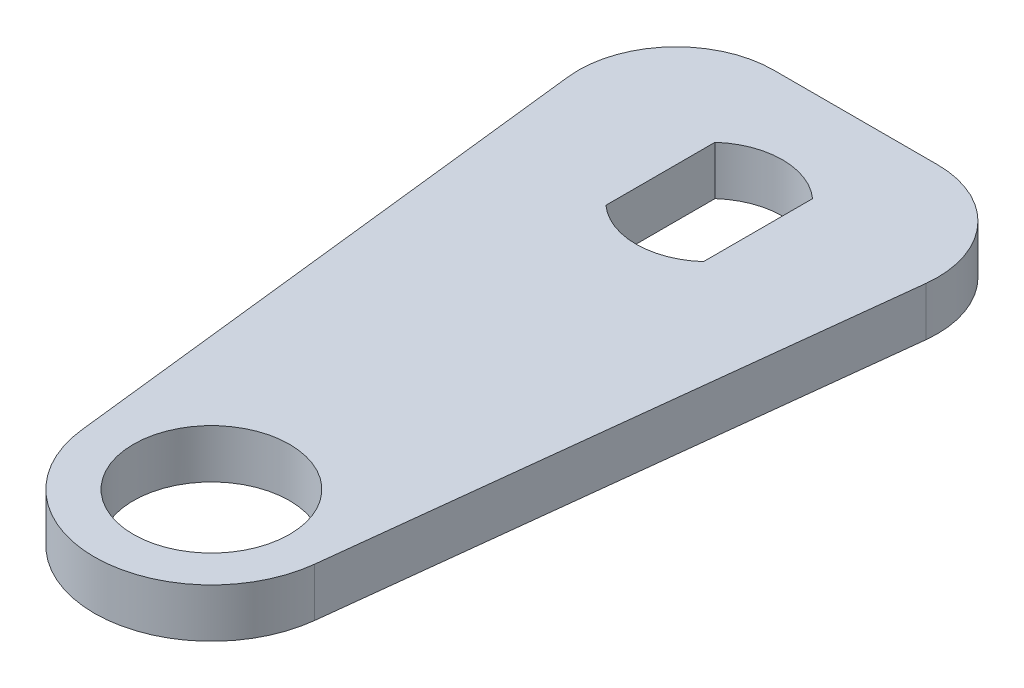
ISO-10303-21;
HEADER;
FILE_DESCRIPTION(('STEP AP214'),'2;1');
FILE_NAME('part.step','',(''),(''),'','','');
FILE_SCHEMA(('AUTOMOTIVE_DESIGN { 1 0 10303 214 1 1 1 1 }'));
ENDSEC;
DATA;
#1=APPLICATION_CONTEXT('core data for automotive mechanical design processes');
#2=APPLICATION_PROTOCOL_DEFINITION('international standard','automotive_design',2000,#1);
#3=PRODUCT_CONTEXT('',#1,'mechanical');
#4=PRODUCT('Part','Part','',(#3));
#5=PRODUCT_RELATED_PRODUCT_CATEGORY('part','',(#4));
#6=PRODUCT_DEFINITION_FORMATION('','',#4);
#7=PRODUCT_DEFINITION_CONTEXT('part definition',#1,'design');
#8=PRODUCT_DEFINITION('design','',#6,#7);
#9=PRODUCT_DEFINITION_SHAPE('','',#8);
#10=(LENGTH_UNIT() NAMED_UNIT(*) SI_UNIT(.MILLI.,.METRE.));
#11=(NAMED_UNIT(*) PLANE_ANGLE_UNIT() SI_UNIT($,.RADIAN.));
#12=(NAMED_UNIT(*) SI_UNIT($,.STERADIAN.) SOLID_ANGLE_UNIT());
#13=UNCERTAINTY_MEASURE_WITH_UNIT(LENGTH_MEASURE(1.E-05),#10,'distance_accuracy_value','');
#14=(GEOMETRIC_REPRESENTATION_CONTEXT(3) GLOBAL_UNCERTAINTY_ASSIGNED_CONTEXT((#13)) GLOBAL_UNIT_ASSIGNED_CONTEXT((#10,
#11,#12)) REPRESENTATION_CONTEXT('',''));
#15=CARTESIAN_POINT('',(0.,0.,0.));
#16=DIRECTION('',(0.,0.,1.));
#17=DIRECTION('',(1.,0.,0.));
#18=AXIS2_PLACEMENT_3D('',#15,#16,#17);
#19=CARTESIAN_POINT('',(-15.8316340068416,5.,18.0515893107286));
#20=DIRECTION('',(-0.993571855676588,0.,0.1132032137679));
#21=DIRECTION('',(0.1132032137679,0.,0.993571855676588));
#22=AXIS2_PLACEMENT_3D('',#19,#20,#21);
#23=PLANE('',#22);
#24=DIRECTION('',(-0.1132032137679,0.,-0.993571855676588));
#25=VECTOR('',#24,1.);
#26=CARTESIAN_POINT('',(-15.8316340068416,5.,18.0515893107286));
#27=LINE('',#26,#25);
#28=CARTESIAN_POINT('',(-11.9228622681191,5.,52.3584385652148));
#29=VERTEX_POINT('',#28);
#30=CARTESIAN_POINT('',(-18.3290520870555,5.,-3.867967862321));
#31=VERTEX_POINT('',#30);
#32=EDGE_CURVE('E150',#29,#31,#27,.T.);
#33=ORIENTED_EDGE('',*,*,#32,.T.);
#34=DIRECTION('',(0.,-1.,0.));
#35=VECTOR('',#34,1.);
#36=CARTESIAN_POINT('',(-18.3290520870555,0.,-3.867967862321));
#37=LINE('',#36,#35);
#38=CARTESIAN_POINT('',(-18.3290520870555,0.,-3.867967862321));
#39=VERTEX_POINT('',#38);
#40=EDGE_CURVE('E11',#31,#39,#37,.T.);
#41=ORIENTED_EDGE('',*,*,#40,.T.);
#42=DIRECTION('',(-0.1132032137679,0.,-0.993571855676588));
#43=VECTOR('',#42,1.);
#44=CARTESIAN_POINT('',(-15.8316340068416,0.,18.0515893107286));
#45=LINE('',#44,#43);
#46=CARTESIAN_POINT('',(-11.9228622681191,0.,52.3584385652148));
#47=VERTEX_POINT('',#46);
#48=EDGE_CURVE('E169',#47,#39,#45,.T.);
#49=ORIENTED_EDGE('',*,*,#48,.F.);
#50=DIRECTION('',(0.,-1.,0.));
#51=VECTOR('',#50,1.);
#52=CARTESIAN_POINT('',(-11.9228622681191,5.,52.3584385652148));
#53=LINE('',#52,#51);
#54=EDGE_CURVE('E178',#29,#47,#53,.T.);
#55=ORIENTED_EDGE('',*,*,#54,.F.);
#56=EDGE_LOOP('',(#33,#41,#49,#55));
#57=FACE_BOUND('',#56,.T.);
#58=ADVANCED_FACE('F34',(#57),#23,.T.);
#59=CARTESIAN_POINT('',(0.,5.,51.));
#60=DIRECTION('',(0.,-1.,0.));
#61=DIRECTION('',(0.,0.,-1.));
#62=AXIS2_PLACEMENT_3D('',#59,#60,#61);
#63=CYLINDRICAL_SURFACE('',#62,12.);
#64=CARTESIAN_POINT('',(0.,0.,51.));
#65=DIRECTION('',(0.,1.,0.));
#66=DIRECTION('',(0.,0.,1.));
#67=AXIS2_PLACEMENT_3D('',#64,#65,#66);
#68=CIRCLE('',#67,12.);
#69=CARTESIAN_POINT('',(11.922862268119,0.,52.3584385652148));
#70=VERTEX_POINT('',#69);
#71=EDGE_CURVE('E172',#47,#70,#68,.T.);
#72=ORIENTED_EDGE('',*,*,#71,.T.);
#73=DIRECTION('',(0.,-1.,0.));
#74=VECTOR('',#73,1.);
#75=CARTESIAN_POINT('',(11.922862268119,5.,52.3584385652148));
#76=LINE('',#75,#74);
#77=CARTESIAN_POINT('',(11.922862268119,5.,52.3584385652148));
#78=VERTEX_POINT('',#77);
#79=EDGE_CURVE('E125',#78,#70,#76,.T.);
#80=ORIENTED_EDGE('',*,*,#79,.F.);
#81=CARTESIAN_POINT('',(0.,5.,51.));
#82=DIRECTION('',(0.,1.,0.));
#83=DIRECTION('',(0.,0.,1.));
#84=AXIS2_PLACEMENT_3D('',#81,#82,#83);
#85=CIRCLE('',#84,12.);
#86=EDGE_CURVE('E152',#29,#78,#85,.T.);
#87=ORIENTED_EDGE('',*,*,#86,.F.);
#88=ORIENTED_EDGE('',*,*,#54,.T.);
#89=EDGE_LOOP('',(#72,#80,#87,#88));
#90=FACE_BOUND('',#89,.T.);
#91=ADVANCED_FACE('F210',(#90),#63,.T.);
#92=CARTESIAN_POINT('',(14.0877689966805,5.,33.3572960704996));
#93=DIRECTION('',(-0.993571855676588,0.,-0.1132032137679));
#94=DIRECTION('',(-0.1132032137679,0.,0.993571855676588));
#95=AXIS2_PLACEMENT_3D('',#92,#93,#94);
#96=PLANE('',#95);
#97=DIRECTION('',(0.1132032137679,0.,-0.993571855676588));
#98=VECTOR('',#97,1.);
#99=CARTESIAN_POINT('',(14.0877689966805,0.,33.3572960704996));
#100=LINE('',#99,#98);
#101=CARTESIAN_POINT('',(18.3290520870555,0.,-3.86796786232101));
#102=VERTEX_POINT('',#101);
#103=EDGE_CURVE('E142',#70,#102,#100,.T.);
#104=ORIENTED_EDGE('',*,*,#103,.T.);
#105=DIRECTION('',(0.,-1.,0.));
#106=VECTOR('',#105,1.);
#107=CARTESIAN_POINT('',(18.3290520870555,5.,-3.867967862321));
#108=LINE('',#107,#106);
#109=CARTESIAN_POINT('',(18.3290520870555,5.,-3.86796786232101));
#110=VERTEX_POINT('',#109);
#111=EDGE_CURVE('E57',#102,#110,#108,.F.);
#112=ORIENTED_EDGE('',*,*,#111,.T.);
#113=DIRECTION('',(0.1132032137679,0.,-0.993571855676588));
#114=VECTOR('',#113,1.);
#115=CARTESIAN_POINT('',(14.0877689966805,5.,33.3572960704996));
#116=LINE('',#115,#114);
#117=EDGE_CURVE('E155',#78,#110,#116,.T.);
#118=ORIENTED_EDGE('',*,*,#117,.F.);
#119=ORIENTED_EDGE('',*,*,#79,.T.);
#120=EDGE_LOOP('',(#104,#112,#118,#119));
#121=FACE_BOUND('',#120,.T.);
#122=ADVANCED_FACE('F206',(#121),#96,.F.);
#123=CARTESIAN_POINT('',(0.,5.,0.));
#124=DIRECTION('',(0.,-1.,0.));
#125=DIRECTION('',(0.,0.,-1.));
#126=AXIS2_PLACEMENT_3D('',#123,#124,#125);
#127=CYLINDRICAL_SURFACE('',#126,7.5);
#128=CARTESIAN_POINT('',(0.,0.,0.));
#129=DIRECTION('',(0.,1.,0.));
#130=DIRECTION('',(0.,0.,1.));
#131=AXIS2_PLACEMENT_3D('',#128,#129,#130);
#132=CIRCLE('',#131,7.5);
#133=CARTESIAN_POINT('',(5.00000000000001,0.,-5.59016994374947));
#134=VERTEX_POINT('',#133);
#135=CARTESIAN_POINT('',(-5.,0.,-5.59016994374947));
#136=VERTEX_POINT('',#135);
#137=EDGE_CURVE('E121',#134,#136,#132,.T.);
#138=ORIENTED_EDGE('',*,*,#137,.F.);
#139=DIRECTION('',(0.,-1.,0.));
#140=VECTOR('',#139,1.);
#141=CARTESIAN_POINT('',(5.00000000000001,5.,-5.59016994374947));
#142=LINE('',#141,#140);
#143=CARTESIAN_POINT('',(5.00000000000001,5.,-5.59016994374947));
#144=VERTEX_POINT('',#143);
#145=EDGE_CURVE('E114',#144,#134,#142,.T.);
#146=ORIENTED_EDGE('',*,*,#145,.F.);
#147=CARTESIAN_POINT('',(0.,5.,0.));
#148=DIRECTION('',(0.,1.,0.));
#149=DIRECTION('',(0.,0.,1.));
#150=AXIS2_PLACEMENT_3D('',#147,#148,#149);
#151=CIRCLE('',#150,7.5);
#152=CARTESIAN_POINT('',(-5.,5.,-5.59016994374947));
#153=VERTEX_POINT('',#152);
#154=EDGE_CURVE('E118',#144,#153,#151,.T.);
#155=ORIENTED_EDGE('',*,*,#154,.T.);
#156=DIRECTION('',(0.,-1.,0.));
#157=VECTOR('',#156,1.);
#158=CARTESIAN_POINT('',(-5.,5.,-5.59016994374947));
#159=LINE('',#158,#157);
#160=EDGE_CURVE('E159',#153,#136,#159,.T.);
#161=ORIENTED_EDGE('',*,*,#160,.T.);
#162=EDGE_LOOP('',(#138,#146,#155,#161));
#163=FACE_BOUND('',#162,.T.);
#164=ADVANCED_FACE('F116',(#163),#127,.F.);
#165=CARTESIAN_POINT('',(5.00000000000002,5.,24.));
#166=DIRECTION('',(1.,0.,0.));
#167=DIRECTION('',(0.,0.,-1.));
#168=AXIS2_PLACEMENT_3D('',#165,#166,#167);
#169=PLANE('',#168);
#170=DIRECTION('',(0.,0.,1.));
#171=VECTOR('',#170,1.);
#172=CARTESIAN_POINT('',(5.00000000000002,0.,24.));
#173=LINE('',#172,#171);
#174=CARTESIAN_POINT('',(5.00000000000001,0.,5.59016994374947));
#175=VERTEX_POINT('',#174);
#176=EDGE_CURVE('E161',#134,#175,#173,.T.);
#177=ORIENTED_EDGE('',*,*,#176,.T.);
#178=DIRECTION('',(0.,-1.,0.));
#179=VECTOR('',#178,1.);
#180=CARTESIAN_POINT('',(5.00000000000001,5.,5.59016994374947));
#181=LINE('',#180,#179);
#182=CARTESIAN_POINT('',(5.00000000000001,5.,5.59016994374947));
#183=VERTEX_POINT('',#182);
#184=EDGE_CURVE('E126',#183,#175,#181,.T.);
#185=ORIENTED_EDGE('',*,*,#184,.F.);
#186=DIRECTION('',(0.,0.,1.));
#187=VECTOR('',#186,1.);
#188=CARTESIAN_POINT('',(5.00000000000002,5.,24.));
#189=LINE('',#188,#187);
#190=EDGE_CURVE('E129',#144,#183,#189,.T.);
#191=ORIENTED_EDGE('',*,*,#190,.F.);
#192=ORIENTED_EDGE('',*,*,#145,.T.);
#193=EDGE_LOOP('',(#177,#185,#191,#192));
#194=FACE_BOUND('',#193,.T.);
#195=ADVANCED_FACE('F130',(#194),#169,.F.);
#196=CARTESIAN_POINT('',(0.,5.,0.));
#197=DIRECTION('',(0.,-1.,0.));
#198=DIRECTION('',(0.,0.,-1.));
#199=AXIS2_PLACEMENT_3D('',#196,#197,#198);
#200=CYLINDRICAL_SURFACE('',#199,7.5);
#201=CARTESIAN_POINT('',(0.,0.,0.));
#202=DIRECTION('',(0.,1.,0.));
#203=DIRECTION('',(0.,0.,1.));
#204=AXIS2_PLACEMENT_3D('',#201,#202,#203);
#205=CIRCLE('',#204,7.5);
#206=CARTESIAN_POINT('',(-5.,0.,5.59016994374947));
#207=VERTEX_POINT('',#206);
#208=EDGE_CURVE('E163',#207,#175,#205,.T.);
#209=ORIENTED_EDGE('',*,*,#208,.F.);
#210=DIRECTION('',(0.,-1.,0.));
#211=VECTOR('',#210,1.);
#212=CARTESIAN_POINT('',(-5.,5.,5.59016994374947));
#213=LINE('',#212,#211);
#214=CARTESIAN_POINT('',(-5.,5.,5.59016994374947));
#215=VERTEX_POINT('',#214);
#216=EDGE_CURVE('E182',#215,#207,#213,.T.);
#217=ORIENTED_EDGE('',*,*,#216,.F.);
#218=CARTESIAN_POINT('',(0.,5.,0.));
#219=DIRECTION('',(0.,1.,0.));
#220=DIRECTION('',(0.,0.,1.));
#221=AXIS2_PLACEMENT_3D('',#218,#219,#220);
#222=CIRCLE('',#221,7.5);
#223=EDGE_CURVE('E134',#215,#183,#222,.T.);
#224=ORIENTED_EDGE('',*,*,#223,.T.);
#225=ORIENTED_EDGE('',*,*,#184,.T.);
#226=EDGE_LOOP('',(#209,#217,#224,#225));
#227=FACE_BOUND('',#226,.T.);
#228=ADVANCED_FACE('F234',(#227),#200,.F.);
#229=CARTESIAN_POINT('',(-5.,5.,24.));
#230=DIRECTION('',(1.,0.,0.));
#231=DIRECTION('',(0.,0.,-1.));
#232=AXIS2_PLACEMENT_3D('',#229,#230,#231);
#233=PLANE('',#232);
#234=DIRECTION('',(0.,0.,1.));
#235=VECTOR('',#234,1.);
#236=CARTESIAN_POINT('',(-5.,0.,24.));
#237=LINE('',#236,#235);
#238=EDGE_CURVE('E166',#136,#207,#237,.T.);
#239=ORIENTED_EDGE('',*,*,#238,.F.);
#240=ORIENTED_EDGE('',*,*,#160,.F.);
#241=DIRECTION('',(0.,0.,1.));
#242=VECTOR('',#241,1.);
#243=CARTESIAN_POINT('',(-5.,5.,24.));
#244=LINE('',#243,#242);
#245=EDGE_CURVE('E138',#153,#215,#244,.T.);
#246=ORIENTED_EDGE('',*,*,#245,.T.);
#247=ORIENTED_EDGE('',*,*,#216,.T.);
#248=EDGE_LOOP('',(#239,#240,#246,#247));
#249=FACE_BOUND('',#248,.T.);
#250=ADVANCED_FACE('F231',(#249),#233,.T.);
#251=CARTESIAN_POINT('',(-68.0401645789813,5.,-15.));
#252=DIRECTION('',(0.,0.,1.));
#253=DIRECTION('',(1.,0.,0.));
#254=AXIS2_PLACEMENT_3D('',#251,#252,#253);
#255=PLANE('',#254);
#256=DIRECTION('',(-1.,0.,0.));
#257=VECTOR('',#256,1.);
#258=CARTESIAN_POINT('',(-68.0401645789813,5.,-15.));
#259=LINE('',#258,#257);
#260=CARTESIAN_POINT('',(8.39333353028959,5.,-15.));
#261=VERTEX_POINT('',#260);
#262=CARTESIAN_POINT('',(-8.39333353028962,5.,-15.));
#263=VERTEX_POINT('',#262);
#264=EDGE_CURVE('E157',#261,#263,#259,.T.);
#265=ORIENTED_EDGE('',*,*,#264,.F.);
#266=DIRECTION('',(0.,-1.,0.));
#267=VECTOR('',#266,1.);
#268=CARTESIAN_POINT('',(8.39333353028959,5.,-15.));
#269=LINE('',#268,#267);
#270=CARTESIAN_POINT('',(8.39333353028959,0.,-15.));
#271=VERTEX_POINT('',#270);
#272=EDGE_CURVE('E186',#261,#271,#269,.T.);
#273=ORIENTED_EDGE('',*,*,#272,.T.);
#274=DIRECTION('',(-1.,0.,0.));
#275=VECTOR('',#274,1.);
#276=CARTESIAN_POINT('',(-68.0401645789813,0.,-15.));
#277=LINE('',#276,#275);
#278=CARTESIAN_POINT('',(-8.39333353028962,0.,-15.));
#279=VERTEX_POINT('',#278);
#280=EDGE_CURVE('E139',#271,#279,#277,.T.);
#281=ORIENTED_EDGE('',*,*,#280,.T.);
#282=DIRECTION('',(0.,-1.,0.));
#283=VECTOR('',#282,1.);
#284=CARTESIAN_POINT('',(-8.39333353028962,5.,-15.));
#285=LINE('',#284,#283);
#286=EDGE_CURVE('E180',#279,#263,#285,.F.);
#287=ORIENTED_EDGE('',*,*,#286,.T.);
#288=EDGE_LOOP('',(#265,#273,#281,#287));
#289=FACE_BOUND('',#288,.T.);
#290=ADVANCED_FACE('F199',(#289),#255,.F.);
#291=CARTESIAN_POINT('',(-68.0401645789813,5.,24.));
#292=DIRECTION('',(0.,1.,0.));
#293=DIRECTION('',(0.,0.,1.));
#294=AXIS2_PLACEMENT_3D('',#291,#292,#293);
#295=PLANE('',#294);
#296=CARTESIAN_POINT('',(0.,5.,51.));
#297=DIRECTION('',(0.,1.,0.));
#298=DIRECTION('',(0.,0.,1.));
#299=AXIS2_PLACEMENT_3D('',#296,#297,#298);
#300=CIRCLE('',#299,8.);
#301=CARTESIAN_POINT('',(0.,5.,59.));
#302=VERTEX_POINT('',#301);
#303=EDGE_CURVE('E145',#302,#302,#300,.T.);
#304=ORIENTED_EDGE('',*,*,#303,.F.);
#305=EDGE_LOOP('',(#304));
#306=FACE_BOUND('',#305,.T.);
#307=ORIENTED_EDGE('',*,*,#154,.F.);
#308=ORIENTED_EDGE('',*,*,#190,.T.);
#309=ORIENTED_EDGE('',*,*,#223,.F.);
#310=ORIENTED_EDGE('',*,*,#245,.F.);
#311=EDGE_LOOP('',(#307,#308,#309,#310));
#312=FACE_BOUND('',#311,.T.);
#313=ORIENTED_EDGE('',*,*,#117,.T.);
#314=CARTESIAN_POINT('',(8.39333353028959,5.,-5.));
#315=DIRECTION('',(0.,1.,0.));
#316=DIRECTION('',(0.,0.,1.));
#317=AXIS2_PLACEMENT_3D('',#314,#315,#316);
#318=CIRCLE('',#317,10.);
#319=EDGE_CURVE('E42',#110,#261,#318,.T.);
#320=ORIENTED_EDGE('',*,*,#319,.T.);
#321=ORIENTED_EDGE('',*,*,#264,.T.);
#322=CARTESIAN_POINT('',(-8.39333353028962,5.,-5.));
#323=DIRECTION('',(0.,1.,0.));
#324=DIRECTION('',(0.,0.,1.));
#325=AXIS2_PLACEMENT_3D('',#322,#323,#324);
#326=CIRCLE('',#325,10.);
#327=EDGE_CURVE('E49',#263,#31,#326,.T.);
#328=ORIENTED_EDGE('',*,*,#327,.T.);
#329=ORIENTED_EDGE('',*,*,#32,.F.);
#330=ORIENTED_EDGE('',*,*,#86,.T.);
#331=EDGE_LOOP('',(#313,#320,#321,#328,#329,#330));
#332=FACE_BOUND('',#331,.T.);
#333=ADVANCED_FACE('F136',(#306,#312,#332),#295,.T.);
#334=CARTESIAN_POINT('',(-68.0401645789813,0.,24.));
#335=DIRECTION('',(0.,1.,0.));
#336=DIRECTION('',(0.,0.,1.));
#337=AXIS2_PLACEMENT_3D('',#334,#335,#336);
#338=PLANE('',#337);
#339=CARTESIAN_POINT('',(0.,0.,51.));
#340=DIRECTION('',(0.,-1.,0.));
#341=DIRECTION('',(0.,0.,-1.));
#342=AXIS2_PLACEMENT_3D('',#339,#340,#341);
#343=CIRCLE('',#342,8.);
#344=CARTESIAN_POINT('',(0.,0.,43.));
#345=VERTEX_POINT('',#344);
#346=EDGE_CURVE('E259',#345,#345,#343,.T.);
#347=ORIENTED_EDGE('',*,*,#346,.F.);
#348=EDGE_LOOP('',(#347));
#349=FACE_BOUND('',#348,.T.);
#350=ORIENTED_EDGE('',*,*,#137,.T.);
#351=ORIENTED_EDGE('',*,*,#238,.T.);
#352=ORIENTED_EDGE('',*,*,#208,.T.);
#353=ORIENTED_EDGE('',*,*,#176,.F.);
#354=EDGE_LOOP('',(#350,#351,#352,#353));
#355=FACE_BOUND('',#354,.T.);
#356=ORIENTED_EDGE('',*,*,#280,.F.);
#357=CARTESIAN_POINT('',(8.39333353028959,0.,-5.));
#358=DIRECTION('',(0.,1.,0.));
#359=DIRECTION('',(0.,0.,1.));
#360=AXIS2_PLACEMENT_3D('',#357,#358,#359);
#361=CIRCLE('',#360,10.);
#362=EDGE_CURVE('E191',#271,#102,#361,.F.);
#363=ORIENTED_EDGE('',*,*,#362,.T.);
#364=ORIENTED_EDGE('',*,*,#103,.F.);
#365=ORIENTED_EDGE('',*,*,#71,.F.);
#366=ORIENTED_EDGE('',*,*,#48,.T.);
#367=CARTESIAN_POINT('',(-8.39333353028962,0.,-5.));
#368=DIRECTION('',(0.,1.,0.));
#369=DIRECTION('',(0.,0.,1.));
#370=AXIS2_PLACEMENT_3D('',#367,#368,#369);
#371=CIRCLE('',#370,10.);
#372=EDGE_CURVE('E189',#39,#279,#371,.F.);
#373=ORIENTED_EDGE('',*,*,#372,.T.);
#374=EDGE_LOOP('',(#356,#363,#364,#365,#366,#373));
#375=FACE_BOUND('',#374,.T.);
#376=ADVANCED_FACE('F204',(#349,#355,#375),#338,.F.);
#377=CARTESIAN_POINT('',(8.39333353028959,5.,-5.));
#378=DIRECTION('',(0.,-1.,0.));
#379=DIRECTION('',(0.,0.,-1.));
#380=AXIS2_PLACEMENT_3D('',#377,#378,#379);
#381=CYLINDRICAL_SURFACE('',#380,10.);
#382=ORIENTED_EDGE('',*,*,#319,.F.);
#383=ORIENTED_EDGE('',*,*,#111,.F.);
#384=ORIENTED_EDGE('',*,*,#362,.F.);
#385=ORIENTED_EDGE('',*,*,#272,.F.);
#386=EDGE_LOOP('',(#382,#383,#384,#385));
#387=FACE_BOUND('',#386,.T.);
#388=ADVANCED_FACE('F202',(#387),#381,.T.);
#389=CARTESIAN_POINT('',(-8.39333353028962,5.,-5.));
#390=DIRECTION('',(0.,1.,0.));
#391=DIRECTION('',(0.,0.,1.));
#392=AXIS2_PLACEMENT_3D('',#389,#390,#391);
#393=CYLINDRICAL_SURFACE('',#392,10.);
#394=ORIENTED_EDGE('',*,*,#327,.F.);
#395=ORIENTED_EDGE('',*,*,#286,.F.);
#396=ORIENTED_EDGE('',*,*,#372,.F.);
#397=ORIENTED_EDGE('',*,*,#40,.F.);
#398=EDGE_LOOP('',(#394,#395,#396,#397));
#399=FACE_BOUND('',#398,.T.);
#400=ADVANCED_FACE('F36',(#399),#393,.T.);
#401=CARTESIAN_POINT('',(0.,10.,51.));
#402=DIRECTION('',(0.,-1.,0.));
#403=DIRECTION('',(0.,0.,-1.));
#404=AXIS2_PLACEMENT_3D('',#401,#402,#403);
#405=CYLINDRICAL_SURFACE('',#404,8.);
#406=ORIENTED_EDGE('',*,*,#303,.T.);
#407=EDGE_LOOP('',(#406));
#408=FACE_BOUND('',#407,.T.);
#409=ORIENTED_EDGE('',*,*,#346,.T.);
#410=EDGE_LOOP('',(#409));
#411=FACE_BOUND('',#410,.T.);
#412=ADVANCED_FACE('F216',(#408,#411),#405,.F.);
#413=CLOSED_SHELL('',(#58,#91,#122,#164,#195,#228,#250,#290,#333,#376,#388,#400,#412));
#414=MANIFOLD_SOLID_BREP('B2',#413);
#415=ADVANCED_BREP_SHAPE_REPRESENTATION('',(#18,#414),#14);
#416=SHAPE_DEFINITION_REPRESENTATION(#9,#415);
ENDSEC;
END-ISO-10303-21;
